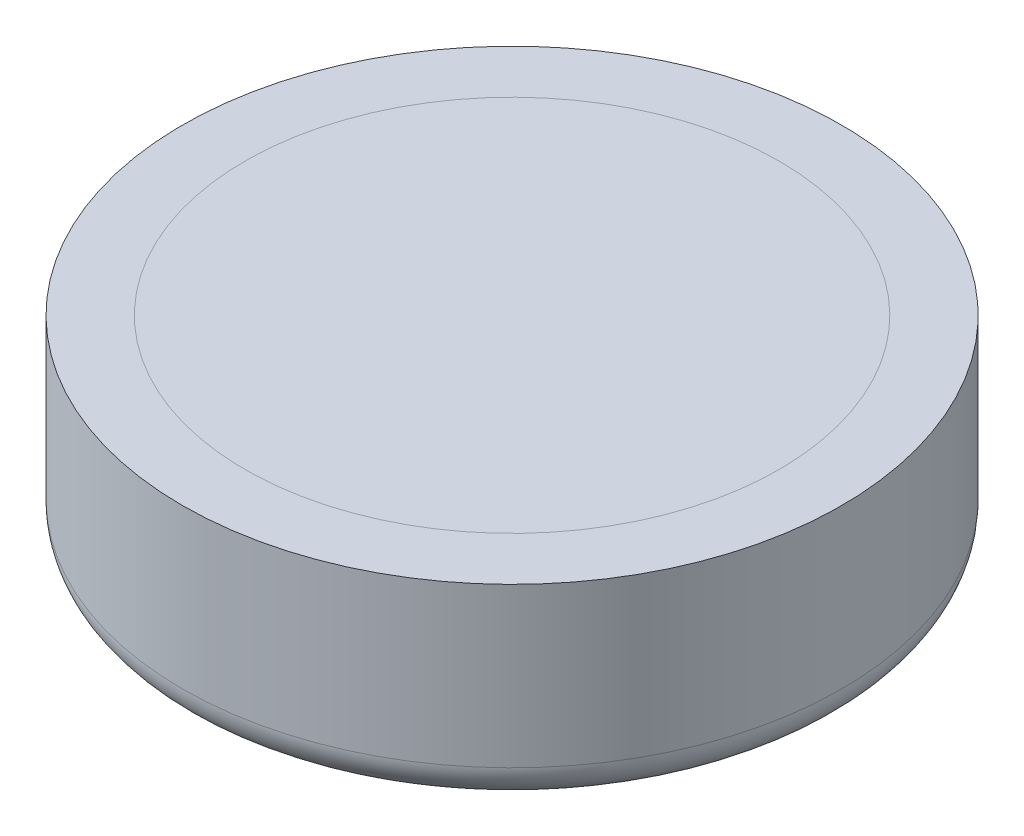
from build123d import *


with BuildPart() as part:
    # Sketch1 → Revolve1 (revolve)
    with BuildSketch(Plane.XY, mode=Mode.PRIVATE) as revolve1_sk:
        with BuildLine():
            Line((0, -20.32), (0, 0))
            Line((0, 0), (34.255211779, 0))
            Line((34.255211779, 0), (34.255211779, -16.509999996))
            ThreePointArc((34.255211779, -16.509999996), (33.139288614, -19.204076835), (30.445211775, -20.32))
            Line((30.445211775, -20.32), (0, -20.32))
        make_face()
    revolve(revolve1_sk.sketch.rotate(Axis((0, 0, 0), (0, -1, 0)), 90), axis=Axis((0, 0, 0), (0, -1, 0)))


solid = part.part
